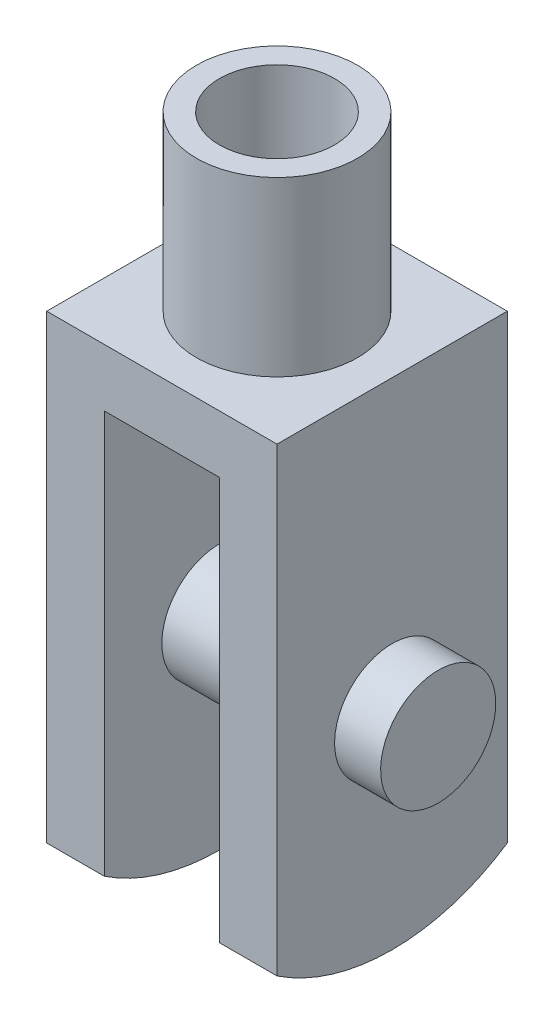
ISO-10303-21;
HEADER;
FILE_DESCRIPTION(('STEP AP214'),'2;1');
FILE_NAME('part.step','',(''),(''),'','','');
FILE_SCHEMA(('AUTOMOTIVE_DESIGN { 1 0 10303 214 1 1 1 1 }'));
ENDSEC;
DATA;
#1=APPLICATION_CONTEXT('core data for automotive mechanical design processes');
#2=APPLICATION_PROTOCOL_DEFINITION('international standard','automotive_design',2000,#1);
#3=PRODUCT_CONTEXT('',#1,'mechanical');
#4=PRODUCT('Part','Part','',(#3));
#5=PRODUCT_RELATED_PRODUCT_CATEGORY('part','',(#4));
#6=PRODUCT_DEFINITION_FORMATION('','',#4);
#7=PRODUCT_DEFINITION_CONTEXT('part definition',#1,'design');
#8=PRODUCT_DEFINITION('design','',#6,#7);
#9=PRODUCT_DEFINITION_SHAPE('','',#8);
#10=(LENGTH_UNIT() NAMED_UNIT(*) SI_UNIT(.MILLI.,.METRE.));
#11=(NAMED_UNIT(*) PLANE_ANGLE_UNIT() SI_UNIT($,.RADIAN.));
#12=(NAMED_UNIT(*) SI_UNIT($,.STERADIAN.) SOLID_ANGLE_UNIT());
#13=UNCERTAINTY_MEASURE_WITH_UNIT(LENGTH_MEASURE(1.E-05),#10,'distance_accuracy_value','');
#14=(GEOMETRIC_REPRESENTATION_CONTEXT(3) GLOBAL_UNCERTAINTY_ASSIGNED_CONTEXT((#13)) GLOBAL_UNIT_ASSIGNED_CONTEXT((#10,
#11,#12)) REPRESENTATION_CONTEXT('',''));
#15=CARTESIAN_POINT('',(0.,0.,0.));
#16=DIRECTION('',(0.,0.,1.));
#17=DIRECTION('',(1.,0.,0.));
#18=AXIS2_PLACEMENT_3D('',#15,#16,#17);
#19=CARTESIAN_POINT('',(-14.,-25.06,5.06));
#20=DIRECTION('',(1.,0.,0.));
#21=DIRECTION('',(0.,0.,-1.));
#22=AXIS2_PLACEMENT_3D('',#19,#20,#21);
#23=PLANE('',#22);
#24=CARTESIAN_POINT('',(-14.,-20.,0.));
#25=DIRECTION('',(-1.,0.,0.));
#26=DIRECTION('',(0.,-1.,0.));
#27=AXIS2_PLACEMENT_3D('',#24,#25,#26);
#28=CIRCLE('',#27,5.);
#29=CARTESIAN_POINT('',(-14.,-25.,0.));
#30=VERTEX_POINT('',#29);
#31=EDGE_CURVE('E214',#30,#30,#28,.T.);
#32=ORIENTED_EDGE('',*,*,#31,.T.);
#33=EDGE_LOOP('',(#32));
#34=FACE_BOUND('',#33,.T.);
#35=ADVANCED_FACE('F16',(#34),#23,.F.);
#36=CARTESIAN_POINT('',(14.,-25.06,5.06));
#37=DIRECTION('',(1.,0.,0.));
#38=DIRECTION('',(0.,0.,-1.));
#39=AXIS2_PLACEMENT_3D('',#36,#37,#38);
#40=PLANE('',#39);
#41=CARTESIAN_POINT('',(14.,-20.,0.));
#42=DIRECTION('',(-1.,0.,0.));
#43=DIRECTION('',(0.,-1.,0.));
#44=AXIS2_PLACEMENT_3D('',#41,#42,#43);
#45=CIRCLE('',#44,5.);
#46=CARTESIAN_POINT('',(14.,-25.,0.));
#47=VERTEX_POINT('',#46);
#48=EDGE_CURVE('E212',#47,#47,#45,.F.);
#49=ORIENTED_EDGE('',*,*,#48,.T.);
#50=EDGE_LOOP('',(#49));
#51=FACE_BOUND('',#50,.T.);
#52=ADVANCED_FACE('F283',(#51),#40,.T.);
#53=CARTESIAN_POINT('',(-7.084,20.,7.084));
#54=DIRECTION('',(0.,-1.,0.));
#55=DIRECTION('',(0.,0.,-1.));
#56=AXIS2_PLACEMENT_3D('',#53,#54,#55);
#57=PLANE('',#56);
#58=CARTESIAN_POINT('',(0.,20.,0.));
#59=DIRECTION('',(0.,1.,0.));
#60=DIRECTION('',(0.,0.,1.));
#61=AXIS2_PLACEMENT_3D('',#58,#59,#60);
#62=CIRCLE('',#61,5.);
#63=CARTESIAN_POINT('',(0.,20.,5.));
#64=VERTEX_POINT('',#63);
#65=EDGE_CURVE('E209',#64,#64,#62,.T.);
#66=ORIENTED_EDGE('',*,*,#65,.F.);
#67=EDGE_LOOP('',(#66));
#68=FACE_BOUND('',#67,.T.);
#69=CARTESIAN_POINT('',(0.,20.,0.));
#70=DIRECTION('',(0.,1.,0.));
#71=DIRECTION('',(-1.,0.,0.));
#72=AXIS2_PLACEMENT_3D('',#69,#70,#71);
#73=CIRCLE('',#72,7.);
#74=CARTESIAN_POINT('',(-7.,20.,0.));
#75=VERTEX_POINT('',#74);
#76=EDGE_CURVE('E20',#75,#75,#73,.T.);
#77=ORIENTED_EDGE('',*,*,#76,.T.);
#78=EDGE_LOOP('',(#77));
#79=FACE_BOUND('',#78,.T.);
#80=ADVANCED_FACE('F221',(#68,#79),#57,.F.);
#81=CARTESIAN_POINT('',(0.,5.,0.));
#82=DIRECTION('',(0.,1.,0.));
#83=DIRECTION('',(-1.,0.,0.));
#84=AXIS2_PLACEMENT_3D('',#81,#82,#83);
#85=CYLINDRICAL_SURFACE('',#84,7.);
#86=ORIENTED_EDGE('',*,*,#76,.F.);
#87=EDGE_LOOP('',(#86));
#88=FACE_BOUND('',#87,.T.);
#89=CARTESIAN_POINT('',(0.,5.,0.));
#90=DIRECTION('',(0.,1.,0.));
#91=DIRECTION('',(-1.,0.,0.));
#92=AXIS2_PLACEMENT_3D('',#89,#90,#91);
#93=CIRCLE('',#92,7.);
#94=CARTESIAN_POINT('',(-7.,5.,0.));
#95=VERTEX_POINT('',#94);
#96=EDGE_CURVE('E173',#95,#95,#93,.T.);
#97=ORIENTED_EDGE('',*,*,#96,.T.);
#98=EDGE_LOOP('',(#97));
#99=FACE_BOUND('',#98,.T.);
#100=ADVANCED_FACE('F223',(#88,#99),#85,.T.);
#101=CARTESIAN_POINT('',(-10.,-20.,0.));
#102=DIRECTION('',(-1.,0.,0.));
#103=DIRECTION('',(0.,-1.,0.));
#104=AXIS2_PLACEMENT_3D('',#101,#102,#103);
#105=CYLINDRICAL_SURFACE('',#104,5.);
#106=ORIENTED_EDGE('',*,*,#31,.F.);
#107=EDGE_LOOP('',(#106));
#108=FACE_BOUND('',#107,.T.);
#109=CARTESIAN_POINT('',(-10.,-20.,0.));
#110=DIRECTION('',(-1.,0.,0.));
#111=DIRECTION('',(0.,-1.,0.));
#112=AXIS2_PLACEMENT_3D('',#109,#110,#111);
#113=CIRCLE('',#112,5.);
#114=CARTESIAN_POINT('',(-10.,-25.,0.));
#115=VERTEX_POINT('',#114);
#116=EDGE_CURVE('E162',#115,#115,#113,.T.);
#117=ORIENTED_EDGE('',*,*,#116,.T.);
#118=EDGE_LOOP('',(#117));
#119=FACE_BOUND('',#118,.T.);
#120=ADVANCED_FACE('F226',(#108,#119),#105,.T.);
#121=CARTESIAN_POINT('',(14.,-20.,0.));
#122=DIRECTION('',(-1.,0.,0.));
#123=DIRECTION('',(0.,-1.,0.));
#124=AXIS2_PLACEMENT_3D('',#121,#122,#123);
#125=CYLINDRICAL_SURFACE('',#124,5.);
#126=ORIENTED_EDGE('',*,*,#48,.F.);
#127=EDGE_LOOP('',(#126));
#128=FACE_BOUND('',#127,.T.);
#129=CARTESIAN_POINT('',(10.,-20.,0.));
#130=DIRECTION('',(-1.,0.,0.));
#131=DIRECTION('',(0.,-1.,0.));
#132=AXIS2_PLACEMENT_3D('',#129,#130,#131);
#133=CIRCLE('',#132,5.);
#134=CARTESIAN_POINT('',(10.,-25.,0.));
#135=VERTEX_POINT('',#134);
#136=EDGE_CURVE('E161',#135,#135,#133,.F.);
#137=ORIENTED_EDGE('',*,*,#136,.T.);
#138=EDGE_LOOP('',(#137));
#139=FACE_BOUND('',#138,.T.);
#140=ADVANCED_FACE('F377',(#128,#139),#125,.T.);
#141=CARTESIAN_POINT('',(0.,0.,0.));
#142=DIRECTION('',(0.,1.,0.));
#143=DIRECTION('',(0.,0.,1.));
#144=AXIS2_PLACEMENT_3D('',#141,#142,#143);
#145=CYLINDRICAL_SURFACE('',#144,5.);
#146=ORIENTED_EDGE('',*,*,#65,.T.);
#147=EDGE_LOOP('',(#146));
#148=FACE_BOUND('',#147,.T.);
#149=CARTESIAN_POINT('',(0.,0.,0.));
#150=DIRECTION('',(0.,1.,0.));
#151=DIRECTION('',(0.,0.,1.));
#152=AXIS2_PLACEMENT_3D('',#149,#150,#151);
#153=CIRCLE('',#152,5.);
#154=CARTESIAN_POINT('',(5.,0.,-5.12758016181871E-10));
#155=VERTEX_POINT('',#154);
#156=CARTESIAN_POINT('',(-5.,0.,-9.61724492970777E-10));
#157=VERTEX_POINT('',#156);
#158=EDGE_CURVE('E180',#155,#157,#153,.F.);
#159=ORIENTED_EDGE('',*,*,#158,.T.);
#160=CARTESIAN_POINT('',(0.,0.,0.));
#161=DIRECTION('',(0.,1.,0.));
#162=DIRECTION('',(0.,0.,1.));
#163=AXIS2_PLACEMENT_3D('',#160,#161,#162);
#164=CIRCLE('',#163,5.);
#165=EDGE_CURVE('E198',#157,#155,#164,.F.);
#166=ORIENTED_EDGE('',*,*,#165,.T.);
#167=EDGE_LOOP('',(#159,#166));
#168=FACE_BOUND('',#167,.T.);
#169=ADVANCED_FACE('F233',(#148,#168),#145,.F.);
#170=CARTESIAN_POINT('',(-10.,5.,-10.));
#171=DIRECTION('',(0.,-1.,0.));
#172=DIRECTION('',(1.,0.,0.));
#173=AXIS2_PLACEMENT_3D('',#170,#171,#172);
#174=PLANE('',#173);
#175=ORIENTED_EDGE('',*,*,#96,.F.);
#176=EDGE_LOOP('',(#175));
#177=FACE_BOUND('',#176,.T.);
#178=DIRECTION('',(0.,0.,1.));
#179=VECTOR('',#178,1.);
#180=CARTESIAN_POINT('',(-10.,5.,0.));
#181=LINE('',#180,#179);
#182=CARTESIAN_POINT('',(-10.,5.,-10.));
#183=VERTEX_POINT('',#182);
#184=CARTESIAN_POINT('',(-10.,5.,10.));
#185=VERTEX_POINT('',#184);
#186=EDGE_CURVE('E171',#183,#185,#181,.T.);
#187=ORIENTED_EDGE('',*,*,#186,.T.);
#188=DIRECTION('',(-1.,0.,0.));
#189=VECTOR('',#188,1.);
#190=CARTESIAN_POINT('',(0.,5.,10.));
#191=LINE('',#190,#189);
#192=CARTESIAN_POINT('',(10.,5.,10.));
#193=VERTEX_POINT('',#192);
#194=EDGE_CURVE('E179',#193,#185,#191,.T.);
#195=ORIENTED_EDGE('',*,*,#194,.F.);
#196=DIRECTION('',(0.,0.,-1.));
#197=VECTOR('',#196,1.);
#198=CARTESIAN_POINT('',(10.,5.,0.));
#199=LINE('',#198,#197);
#200=CARTESIAN_POINT('',(10.,5.,-10.));
#201=VERTEX_POINT('',#200);
#202=EDGE_CURVE('E159',#193,#201,#199,.T.);
#203=ORIENTED_EDGE('',*,*,#202,.T.);
#204=DIRECTION('',(-1.,0.,0.));
#205=VECTOR('',#204,1.);
#206=CARTESIAN_POINT('',(0.,5.,-10.));
#207=LINE('',#206,#205);
#208=EDGE_CURVE('E77',#201,#183,#207,.T.);
#209=ORIENTED_EDGE('',*,*,#208,.T.);
#210=EDGE_LOOP('',(#187,#195,#203,#209));
#211=FACE_BOUND('',#210,.T.);
#212=ADVANCED_FACE('F230',(#177,#211),#174,.F.);
#213=CARTESIAN_POINT('',(-10.,-38.291570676,-10.));
#214=DIRECTION('',(1.,0.,0.));
#215=DIRECTION('',(0.,1.,0.));
#216=AXIS2_PLACEMENT_3D('',#213,#214,#215);
#217=PLANE('',#216);
#218=ORIENTED_EDGE('',*,*,#116,.F.);
#219=EDGE_LOOP('',(#218));
#220=FACE_BOUND('',#219,.T.);
#221=CARTESIAN_POINT('',(-10.,-20.033370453,0.));
#222=DIRECTION('',(1.,0.,0.));
#223=DIRECTION('',(0.,1.,0.));
#224=AXIS2_PLACEMENT_3D('',#221,#222,#223);
#225=CIRCLE('',#224,18.);
#226=CARTESIAN_POINT('',(-10.,-35.0000000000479,-10.));
#227=VERTEX_POINT('',#226);
#228=CARTESIAN_POINT('',(-10.,-35.0000000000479,10.));
#229=VERTEX_POINT('',#228);
#230=EDGE_CURVE('E201',#227,#229,#225,.F.);
#231=ORIENTED_EDGE('',*,*,#230,.T.);
#232=DIRECTION('',(0.,-1.,0.));
#233=VECTOR('',#232,1.);
#234=CARTESIAN_POINT('',(-10.,-15.,10.));
#235=LINE('',#234,#233);
#236=EDGE_CURVE('E143',#185,#229,#235,.T.);
#237=ORIENTED_EDGE('',*,*,#236,.F.);
#238=ORIENTED_EDGE('',*,*,#186,.F.);
#239=DIRECTION('',(0.,-1.,0.));
#240=VECTOR('',#239,1.);
#241=CARTESIAN_POINT('',(-10.,-15.,-10.));
#242=LINE('',#241,#240);
#243=EDGE_CURVE('E70',#183,#227,#242,.T.);
#244=ORIENTED_EDGE('',*,*,#243,.T.);
#245=EDGE_LOOP('',(#231,#237,#238,#244));
#246=FACE_BOUND('',#245,.T.);
#247=ADVANCED_FACE('F232',(#220,#246),#217,.F.);
#248=CARTESIAN_POINT('',(10.,5.,-10.));
#249=DIRECTION('',(-1.,0.,0.));
#250=DIRECTION('',(0.,-1.,0.));
#251=AXIS2_PLACEMENT_3D('',#248,#249,#250);
#252=PLANE('',#251);
#253=ORIENTED_EDGE('',*,*,#136,.F.);
#254=EDGE_LOOP('',(#253));
#255=FACE_BOUND('',#254,.T.);
#256=CARTESIAN_POINT('',(10.,-20.033370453,0.));
#257=DIRECTION('',(1.,0.,0.));
#258=DIRECTION('',(0.,1.,0.));
#259=AXIS2_PLACEMENT_3D('',#256,#257,#258);
#260=CIRCLE('',#259,18.);
#261=CARTESIAN_POINT('',(10.,-34.9999999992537,10.0000000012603));
#262=VERTEX_POINT('',#261);
#263=CARTESIAN_POINT('',(10.,-35.0000000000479,-10.));
#264=VERTEX_POINT('',#263);
#265=EDGE_CURVE('E132',#262,#264,#260,.T.);
#266=ORIENTED_EDGE('',*,*,#265,.T.);
#267=DIRECTION('',(0.,1.,0.));
#268=VECTOR('',#267,1.);
#269=CARTESIAN_POINT('',(10.,-15.,-10.));
#270=LINE('',#269,#268);
#271=EDGE_CURVE('E147',#264,#201,#270,.T.);
#272=ORIENTED_EDGE('',*,*,#271,.T.);
#273=ORIENTED_EDGE('',*,*,#202,.F.);
#274=DIRECTION('',(0.,1.,0.));
#275=VECTOR('',#274,1.);
#276=CARTESIAN_POINT('',(10.,-15.,10.));
#277=LINE('',#276,#275);
#278=EDGE_CURVE('E176',#262,#193,#277,.T.);
#279=ORIENTED_EDGE('',*,*,#278,.F.);
#280=EDGE_LOOP('',(#266,#272,#273,#279));
#281=FACE_BOUND('',#280,.T.);
#282=ADVANCED_FACE('F242',(#255,#281),#252,.F.);
#283=CARTESIAN_POINT('',(-10.,-20.033370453,0.));
#284=DIRECTION('',(1.,0.,0.));
#285=DIRECTION('',(0.,1.,0.));
#286=AXIS2_PLACEMENT_3D('',#283,#284,#285);
#287=CYLINDRICAL_SURFACE('',#286,18.);
#288=ORIENTED_EDGE('',*,*,#230,.F.);
#289=DIRECTION('',(1.,0.,0.));
#290=VECTOR('',#289,1.);
#291=CARTESIAN_POINT('',(0.,-35.,-10.));
#292=LINE('',#291,#290);
#293=CARTESIAN_POINT('',(-5.,-35.0000000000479,-10.));
#294=VERTEX_POINT('',#293);
#295=EDGE_CURVE('E107',#227,#294,#292,.T.);
#296=ORIENTED_EDGE('',*,*,#295,.T.);
#297=CARTESIAN_POINT('',(-5.,-20.033370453,0.));
#298=DIRECTION('',(1.,0.,0.));
#299=DIRECTION('',(0.,1.,0.));
#300=AXIS2_PLACEMENT_3D('',#297,#298,#299);
#301=CIRCLE('',#300,18.);
#302=CARTESIAN_POINT('',(-5.,-35.0000000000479,10.));
#303=VERTEX_POINT('',#302);
#304=EDGE_CURVE('E122',#294,#303,#301,.F.);
#305=ORIENTED_EDGE('',*,*,#304,.T.);
#306=DIRECTION('',(1.,0.,0.));
#307=VECTOR('',#306,1.);
#308=CARTESIAN_POINT('',(0.,-35.,10.));
#309=LINE('',#308,#307);
#310=EDGE_CURVE('E136',#229,#303,#309,.T.);
#311=ORIENTED_EDGE('',*,*,#310,.F.);
#312=EDGE_LOOP('',(#288,#296,#305,#311));
#313=FACE_BOUND('',#312,.T.);
#314=ADVANCED_FACE('F246',(#313),#287,.T.);
#315=CARTESIAN_POINT('',(5.,0.,-10.));
#316=DIRECTION('',(0.,1.,0.));
#317=DIRECTION('',(-1.,0.,0.));
#318=AXIS2_PLACEMENT_3D('',#315,#316,#317);
#319=PLANE('',#318);
#320=ORIENTED_EDGE('',*,*,#165,.F.);
#321=DIRECTION('',(0.,0.,-1.));
#322=VECTOR('',#321,1.);
#323=CARTESIAN_POINT('',(-5.,0.,0.));
#324=LINE('',#323,#322);
#325=CARTESIAN_POINT('',(-5.,0.,-10.));
#326=VERTEX_POINT('',#325);
#327=EDGE_CURVE('E102',#157,#326,#324,.T.);
#328=ORIENTED_EDGE('',*,*,#327,.T.);
#329=DIRECTION('',(1.,0.,0.));
#330=VECTOR('',#329,1.);
#331=CARTESIAN_POINT('',(0.,0.,-10.));
#332=LINE('',#331,#330);
#333=CARTESIAN_POINT('',(5.,0.,-10.));
#334=VERTEX_POINT('',#333);
#335=EDGE_CURVE('E95',#326,#334,#332,.T.);
#336=ORIENTED_EDGE('',*,*,#335,.T.);
#337=DIRECTION('',(0.,0.,1.));
#338=VECTOR('',#337,1.);
#339=CARTESIAN_POINT('',(5.,0.,0.));
#340=LINE('',#339,#338);
#341=EDGE_CURVE('E99',#334,#155,#340,.T.);
#342=ORIENTED_EDGE('',*,*,#341,.T.);
#343=EDGE_LOOP('',(#320,#328,#336,#342));
#344=FACE_BOUND('',#343,.T.);
#345=ADVANCED_FACE('F97',(#344),#319,.F.);
#346=CARTESIAN_POINT('',(5.,0.,-0.06));
#347=DIRECTION('',(0.,1.,0.));
#348=DIRECTION('',(-1.,0.,0.));
#349=AXIS2_PLACEMENT_3D('',#346,#347,#348);
#350=PLANE('',#349);
#351=ORIENTED_EDGE('',*,*,#158,.F.);
#352=DIRECTION('',(0.,0.,1.));
#353=VECTOR('',#352,1.);
#354=CARTESIAN_POINT('',(5.,0.,0.));
#355=LINE('',#354,#353);
#356=CARTESIAN_POINT('',(5.,0.,10.));
#357=VERTEX_POINT('',#356);
#358=EDGE_CURVE('E116',#155,#357,#355,.T.);
#359=ORIENTED_EDGE('',*,*,#358,.T.);
#360=DIRECTION('',(1.,0.,0.));
#361=VECTOR('',#360,1.);
#362=CARTESIAN_POINT('',(0.,0.,10.));
#363=LINE('',#362,#361);
#364=CARTESIAN_POINT('',(-5.,0.,10.));
#365=VERTEX_POINT('',#364);
#366=EDGE_CURVE('E133',#365,#357,#363,.T.);
#367=ORIENTED_EDGE('',*,*,#366,.F.);
#368=DIRECTION('',(0.,0.,-1.));
#369=VECTOR('',#368,1.);
#370=CARTESIAN_POINT('',(-5.,0.,0.));
#371=LINE('',#370,#369);
#372=EDGE_CURVE('E144',#365,#157,#371,.T.);
#373=ORIENTED_EDGE('',*,*,#372,.T.);
#374=EDGE_LOOP('',(#351,#359,#367,#373));
#375=FACE_BOUND('',#374,.T.);
#376=ADVANCED_FACE('F252',(#375),#350,.F.);
#377=CARTESIAN_POINT('',(-10.,-35.,10.));
#378=DIRECTION('',(0.,0.,1.));
#379=DIRECTION('',(1.,0.,0.));
#380=AXIS2_PLACEMENT_3D('',#377,#378,#379);
#381=PLANE('',#380);
#382=ORIENTED_EDGE('',*,*,#366,.T.);
#383=DIRECTION('',(0.,-1.,0.));
#384=VECTOR('',#383,1.);
#385=CARTESIAN_POINT('',(5.,-19.130785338,10.));
#386=LINE('',#385,#384);
#387=CARTESIAN_POINT('',(5.,-34.9999999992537,10.0000000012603));
#388=VERTEX_POINT('',#387);
#389=EDGE_CURVE('E119',#357,#388,#386,.T.);
#390=ORIENTED_EDGE('',*,*,#389,.T.);
#391=DIRECTION('',(-1.,0.,0.));
#392=VECTOR('',#391,1.);
#393=CARTESIAN_POINT('',(7.5,-34.9999999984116,10.0000000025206));
#394=LINE('',#393,#392);
#395=EDGE_CURVE('E129',#388,#262,#394,.F.);
#396=ORIENTED_EDGE('',*,*,#395,.T.);
#397=ORIENTED_EDGE('',*,*,#278,.T.);
#398=ORIENTED_EDGE('',*,*,#194,.T.);
#399=ORIENTED_EDGE('',*,*,#236,.T.);
#400=ORIENTED_EDGE('',*,*,#310,.T.);
#401=DIRECTION('',(0.,1.,0.));
#402=VECTOR('',#401,1.);
#403=CARTESIAN_POINT('',(-5.,-19.130785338,10.));
#404=LINE('',#403,#402);
#405=EDGE_CURVE('E117',#303,#365,#404,.T.);
#406=ORIENTED_EDGE('',*,*,#405,.T.);
#407=EDGE_LOOP('',(#382,#390,#396,#397,#398,#399,#400,#406));
#408=FACE_BOUND('',#407,.T.);
#409=ADVANCED_FACE('F239',(#408),#381,.T.);
#410=CARTESIAN_POINT('',(5.,-20.033370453,0.));
#411=DIRECTION('',(1.,0.,0.));
#412=DIRECTION('',(0.,1.,0.));
#413=AXIS2_PLACEMENT_3D('',#410,#411,#412);
#414=CYLINDRICAL_SURFACE('',#413,18.);
#415=ORIENTED_EDGE('',*,*,#265,.F.);
#416=ORIENTED_EDGE('',*,*,#395,.F.);
#417=CARTESIAN_POINT('',(5.,-20.033370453,0.));
#418=DIRECTION('',(1.,0.,0.));
#419=DIRECTION('',(0.,1.,0.));
#420=AXIS2_PLACEMENT_3D('',#417,#418,#419);
#421=CIRCLE('',#420,18.);
#422=CARTESIAN_POINT('',(5.,-35.0000000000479,-10.));
#423=VERTEX_POINT('',#422);
#424=EDGE_CURVE('E35',#388,#423,#421,.T.);
#425=ORIENTED_EDGE('',*,*,#424,.T.);
#426=DIRECTION('',(1.,0.,0.));
#427=VECTOR('',#426,1.);
#428=CARTESIAN_POINT('',(0.,-35.,-10.));
#429=LINE('',#428,#427);
#430=EDGE_CURVE('E106',#423,#264,#429,.T.);
#431=ORIENTED_EDGE('',*,*,#430,.T.);
#432=EDGE_LOOP('',(#415,#416,#425,#431));
#433=FACE_BOUND('',#432,.T.);
#434=ADVANCED_FACE('F259',(#433),#414,.T.);
#435=CARTESIAN_POINT('',(-10.,-35.,-10.));
#436=DIRECTION('',(0.,0.,1.));
#437=DIRECTION('',(1.,0.,0.));
#438=AXIS2_PLACEMENT_3D('',#435,#436,#437);
#439=PLANE('',#438);
#440=ORIENTED_EDGE('',*,*,#430,.F.);
#441=DIRECTION('',(0.,1.,0.));
#442=VECTOR('',#441,1.);
#443=CARTESIAN_POINT('',(5.,-19.130785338,-10.));
#444=LINE('',#443,#442);
#445=EDGE_CURVE('E110',#423,#334,#444,.T.);
#446=ORIENTED_EDGE('',*,*,#445,.T.);
#447=ORIENTED_EDGE('',*,*,#335,.F.);
#448=DIRECTION('',(0.,-1.,0.));
#449=VECTOR('',#448,1.);
#450=CARTESIAN_POINT('',(-5.,-19.130785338,-10.));
#451=LINE('',#450,#449);
#452=EDGE_CURVE('E152',#326,#294,#451,.T.);
#453=ORIENTED_EDGE('',*,*,#452,.T.);
#454=ORIENTED_EDGE('',*,*,#295,.F.);
#455=ORIENTED_EDGE('',*,*,#243,.F.);
#456=ORIENTED_EDGE('',*,*,#208,.F.);
#457=ORIENTED_EDGE('',*,*,#271,.F.);
#458=EDGE_LOOP('',(#440,#446,#447,#453,#454,#455,#456,#457));
#459=FACE_BOUND('',#458,.T.);
#460=ADVANCED_FACE('F111',(#459),#439,.F.);
#461=CARTESIAN_POINT('',(-5.,-38.261570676,-10.));
#462=DIRECTION('',(-1.,0.,0.));
#463=DIRECTION('',(0.,0.,1.));
#464=AXIS2_PLACEMENT_3D('',#461,#462,#463);
#465=PLANE('',#464);
#466=CARTESIAN_POINT('',(-5.,-20.,0.));
#467=DIRECTION('',(-1.,0.,0.));
#468=DIRECTION('',(0.,-1.,0.));
#469=AXIS2_PLACEMENT_3D('',#466,#467,#468);
#470=CIRCLE('',#469,5.);
#471=CARTESIAN_POINT('',(-5.,-25.,0.));
#472=VERTEX_POINT('',#471);
#473=EDGE_CURVE('E26',#472,#472,#470,.T.);
#474=ORIENTED_EDGE('',*,*,#473,.T.);
#475=EDGE_LOOP('',(#474));
#476=FACE_BOUND('',#475,.T.);
#477=ORIENTED_EDGE('',*,*,#304,.F.);
#478=ORIENTED_EDGE('',*,*,#452,.F.);
#479=ORIENTED_EDGE('',*,*,#327,.F.);
#480=ORIENTED_EDGE('',*,*,#372,.F.);
#481=ORIENTED_EDGE('',*,*,#405,.F.);
#482=EDGE_LOOP('',(#477,#478,#479,#480,#481));
#483=FACE_BOUND('',#482,.T.);
#484=ADVANCED_FACE('F250',(#476,#483),#465,.F.);
#485=CARTESIAN_POINT('',(5.,-38.261570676,-10.));
#486=DIRECTION('',(1.,0.,0.));
#487=DIRECTION('',(0.,1.,0.));
#488=AXIS2_PLACEMENT_3D('',#485,#486,#487);
#489=PLANE('',#488);
#490=CARTESIAN_POINT('',(5.,-20.,0.));
#491=DIRECTION('',(-1.,0.,0.));
#492=DIRECTION('',(0.,-1.,0.));
#493=AXIS2_PLACEMENT_3D('',#490,#491,#492);
#494=CIRCLE('',#493,5.);
#495=CARTESIAN_POINT('',(5.,-25.,0.));
#496=VERTEX_POINT('',#495);
#497=EDGE_CURVE('E11',#496,#496,#494,.F.);
#498=ORIENTED_EDGE('',*,*,#497,.T.);
#499=EDGE_LOOP('',(#498));
#500=FACE_BOUND('',#499,.T.);
#501=ORIENTED_EDGE('',*,*,#424,.F.);
#502=ORIENTED_EDGE('',*,*,#389,.F.);
#503=ORIENTED_EDGE('',*,*,#358,.F.);
#504=ORIENTED_EDGE('',*,*,#341,.F.);
#505=ORIENTED_EDGE('',*,*,#445,.F.);
#506=EDGE_LOOP('',(#501,#502,#503,#504,#505));
#507=FACE_BOUND('',#506,.T.);
#508=ADVANCED_FACE('F18',(#500,#507),#489,.F.);
#509=CARTESIAN_POINT('',(5.,-20.,0.));
#510=DIRECTION('',(-1.,0.,0.));
#511=DIRECTION('',(0.,-1.,0.));
#512=AXIS2_PLACEMENT_3D('',#509,#510,#511);
#513=CYLINDRICAL_SURFACE('',#512,5.);
#514=ORIENTED_EDGE('',*,*,#473,.F.);
#515=EDGE_LOOP('',(#514));
#516=FACE_BOUND('',#515,.T.);
#517=ORIENTED_EDGE('',*,*,#497,.F.);
#518=EDGE_LOOP('',(#517));
#519=FACE_BOUND('',#518,.T.);
#520=ADVANCED_FACE('F271',(#516,#519),#513,.T.);
#521=CLOSED_SHELL('',(#35,#52,#80,#100,#120,#140,#169,#212,#247,#282,#314,#345,#376,#409,#434,
#460,#484,#508,#520));
#522=MANIFOLD_SOLID_BREP('B1',#521);
#523=ADVANCED_BREP_SHAPE_REPRESENTATION('',(#18,#522),#14);
#524=SHAPE_DEFINITION_REPRESENTATION(#9,#523);
ENDSEC;
END-ISO-10303-21;
